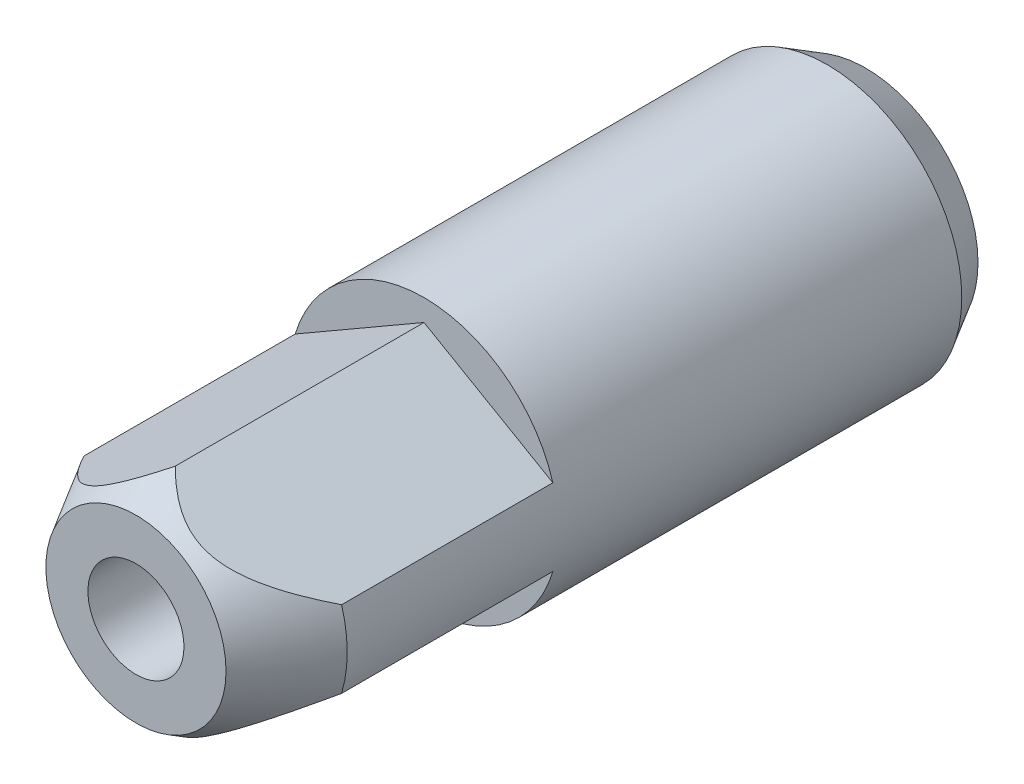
ISO-10303-21;
HEADER;
FILE_DESCRIPTION(('STEP AP214'),'2;1');
FILE_NAME('part.step','',(''),(''),'','','');
FILE_SCHEMA(('AUTOMOTIVE_DESIGN { 1 0 10303 214 1 1 1 1 }'));
ENDSEC;
DATA;
#1=APPLICATION_CONTEXT('core data for automotive mechanical design processes');
#2=APPLICATION_PROTOCOL_DEFINITION('international standard','automotive_design',2000,#1);
#3=PRODUCT_CONTEXT('',#1,'mechanical');
#4=PRODUCT('Part','Part','',(#3));
#5=PRODUCT_RELATED_PRODUCT_CATEGORY('part','',(#4));
#6=PRODUCT_DEFINITION_FORMATION('','',#4);
#7=PRODUCT_DEFINITION_CONTEXT('part definition',#1,'design');
#8=PRODUCT_DEFINITION('design','',#6,#7);
#9=PRODUCT_DEFINITION_SHAPE('','',#8);
#10=(LENGTH_UNIT() NAMED_UNIT(*) SI_UNIT(.MILLI.,.METRE.));
#11=(NAMED_UNIT(*) PLANE_ANGLE_UNIT() SI_UNIT($,.RADIAN.));
#12=(NAMED_UNIT(*) SI_UNIT($,.STERADIAN.) SOLID_ANGLE_UNIT());
#13=UNCERTAINTY_MEASURE_WITH_UNIT(LENGTH_MEASURE(1.E-05),#10,'distance_accuracy_value','');
#14=(GEOMETRIC_REPRESENTATION_CONTEXT(3) GLOBAL_UNCERTAINTY_ASSIGNED_CONTEXT((#13)) GLOBAL_UNIT_ASSIGNED_CONTEXT((#10,
#11,#12)) REPRESENTATION_CONTEXT('',''));
#15=CARTESIAN_POINT('',(0.,0.,0.));
#16=DIRECTION('',(0.,0.,1.));
#17=DIRECTION('',(1.,0.,0.));
#18=AXIS2_PLACEMENT_3D('',#15,#16,#17);
#19=CARTESIAN_POINT('',(0.,0.,34.));
#20=DIRECTION('',(0.,0.,-1.));
#21=DIRECTION('',(-1.,0.,0.));
#22=AXIS2_PLACEMENT_3D('',#19,#20,#21);
#23=CONICAL_SURFACE('',#22,7.,0.523598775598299);
#24=CARTESIAN_POINT('',(0.,0.,38.));
#25=DIRECTION('',(0.,0.,1.));
#26=DIRECTION('',(1.,0.,0.));
#27=AXIS2_PLACEMENT_3D('',#24,#25,#26);
#28=CIRCLE('',#27,4.69059892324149);
#29=CARTESIAN_POINT('',(4.69059892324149,0.,38.));
#30=VERTEX_POINT('',#29);
#31=EDGE_CURVE('E23',#30,#30,#28,.T.);
#32=ORIENTED_EDGE('',*,*,#31,.F.);
#33=EDGE_LOOP('',(#32));
#34=FACE_BOUND('',#33,.T.);
#35=CARTESIAN_POINT('',(-0.0002,5.87309881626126,35.9518500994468));
#36=CARTESIAN_POINT('',(0.0529864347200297,5.84239161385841,36.0050342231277));
#37=CARTESIAN_POINT('',(0.106703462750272,5.81137807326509,36.0575091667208));
#38=CARTESIAN_POINT('',(0.215315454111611,5.7486709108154,36.1608430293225));
#39=CARTESIAN_POINT('',(0.270210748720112,5.71697709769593,36.2117014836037));
#40=CARTESIAN_POINT('',(0.437358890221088,5.6204740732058,36.3620190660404));
#41=CARTESIAN_POINT('',(0.551534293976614,5.55455487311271,36.4586741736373));
#42=CARTESIAN_POINT('',(0.788819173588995,5.41755838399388,36.6445045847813));
#43=CARTESIAN_POINT('',(0.912084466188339,5.3463911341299,36.7334170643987));
#44=CARTESIAN_POINT('',(1.16529399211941,5.20020054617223,36.8970695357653));
#45=CARTESIAN_POINT('',(1.29522262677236,5.12518621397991,36.971840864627));
#46=CARTESIAN_POINT('',(1.50113825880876,5.00630076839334,37.0728579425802));
#47=CARTESIAN_POINT('',(1.57471376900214,4.96382192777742,37.1056861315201));
#48=CARTESIAN_POINT('',(1.72379175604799,4.87775171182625,37.1649793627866));
#49=CARTESIAN_POINT('',(1.79929437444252,4.83416025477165,37.1914439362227));
#50=CARTESIAN_POINT('',(1.95132510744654,4.74638527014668,37.2369981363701));
#51=CARTESIAN_POINT('',(2.02784035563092,4.70220917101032,37.2561445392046));
#52=CARTESIAN_POINT('',(2.18202244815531,4.61319209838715,37.2866655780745));
#53=CARTESIAN_POINT('',(2.25968907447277,4.56835125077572,37.2980416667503));
#54=CARTESIAN_POINT('',(2.41635054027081,4.47790271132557,37.3126377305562));
#55=CARTESIAN_POINT('',(2.49535097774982,4.43229178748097,37.3157786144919));
#56=CARTESIAN_POINT('',(2.65325881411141,4.34112365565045,37.3135398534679));
#57=CARTESIAN_POINT('',(2.73216621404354,4.29556644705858,37.3081603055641));
#58=CARTESIAN_POINT('',(2.88933707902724,4.20482380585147,37.2890977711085));
#59=CARTESIAN_POINT('',(2.96759940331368,4.15963903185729,37.2754023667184));
#60=CARTESIAN_POINT('',(3.12283420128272,4.07001417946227,37.2402403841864));
#61=CARTESIAN_POINT('',(3.19980587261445,4.02557456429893,37.2187691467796));
#62=CARTESIAN_POINT('',(3.37375422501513,3.9251454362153,37.1616717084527));
#63=CARTESIAN_POINT('',(3.47016647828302,3.8694817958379,37.1237542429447));
#64=CARTESIAN_POINT('',(3.65967695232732,3.76006787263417,37.038108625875));
#65=CARTESIAN_POINT('',(3.75277310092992,3.70631878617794,36.9903744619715));
#66=CARTESIAN_POINT('',(3.9363598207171,3.60032494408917,36.8863630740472));
#67=CARTESIAN_POINT('',(4.02681802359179,3.54809887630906,36.8300103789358));
#68=CARTESIAN_POINT('',(4.20431504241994,3.44562092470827,36.710654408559));
#69=CARTESIAN_POINT('',(4.29135478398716,3.39536850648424,36.6476529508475));
#70=CARTESIAN_POINT('',(4.49230790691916,3.27934816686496,36.4931903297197));
#71=CARTESIAN_POINT('',(4.60493225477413,3.21432446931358,36.3995008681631));
#72=CARTESIAN_POINT('',(4.82523970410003,3.0871299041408,36.2046332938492));
#73=CARTESIAN_POINT('',(4.93292034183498,3.02496045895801,36.1034515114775));
#74=CARTESIAN_POINT('',(5.14433636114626,2.90289936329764,35.8950283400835));
#75=CARTESIAN_POINT('',(5.2480586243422,2.84301528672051,35.7877693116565));
#76=CARTESIAN_POINT('',(5.45185763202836,2.72535187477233,35.5687242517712));
#77=CARTESIAN_POINT('',(5.55193392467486,2.66757280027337,35.4569376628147));
#78=CARTESIAN_POINT('',(5.74358661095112,2.55692207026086,35.235978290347));
#79=CARTESIAN_POINT('',(5.83532868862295,2.50395475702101,35.1269963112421));
#80=CARTESIAN_POINT('',(6.01641515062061,2.39940443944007,34.9063984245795));
#81=CARTESIAN_POINT('',(6.10575934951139,2.34782154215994,34.7947823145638));
#82=CARTESIAN_POINT('',(6.28167784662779,2.24625495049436,34.5702575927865));
#83=CARTESIAN_POINT('',(6.368268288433,2.19626193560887,34.4573657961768));
#84=CARTESIAN_POINT('',(6.53963078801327,2.09732575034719,34.2298035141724));
#85=CARTESIAN_POINT('',(6.62440328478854,2.04838232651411,34.1151334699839));
#86=CARTESIAN_POINT('',(6.70840393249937,1.99988452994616,33.9997251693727));
#87=B_SPLINE_CURVE_WITH_KNOTS('',3,(#35,#36,#37,#38,#39,#40,#41,#42,#43,#44,#45,#46,#47,#48,#49,
#50,#51,#52,#53,#54,#55,#56,#57,#58,#59,#60,#61,#62,#63,#64,#65,#66,#67,#68,#69,#70,#71,#72,#73,
#74,#75,#76,#77,#78,#79,#80,#81,#82,#83,#84,#85,#86),.UNSPECIFIED.,.F.,.F.,(4,2,2,2,2,2,2,2,2,2,
2,2,2,2,2,2,2,2,2,2,2,2,2,2,2,4),(0.,0.243715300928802,0.487500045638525,0.977552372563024,
1.48046379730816,1.98224735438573,2.25527955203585,2.52833186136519,2.79922055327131,
3.07005858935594,3.34348839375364,3.61691508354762,3.89075108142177,4.16475143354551,
4.51700036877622,4.86946568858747,5.22521580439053,5.58086892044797,6.06133859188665,
6.54204516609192,7.02422662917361,7.50646764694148,7.96236501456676,8.41829753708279,
8.87068237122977,9.32295670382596),.UNSPECIFIED.);
#88=CARTESIAN_POINT('',(0.,5.87298334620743,35.952050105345));
#89=VERTEX_POINT('',#88);
#90=CARTESIAN_POINT('',(6.70820393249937,2.,34.));
#91=VERTEX_POINT('',#90);
#92=EDGE_CURVE('E102',#89,#91,#87,.T.);
#93=ORIENTED_EDGE('',*,*,#92,.F.);
#94=CARTESIAN_POINT('',(0.0002,5.87309881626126,35.9518500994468));
#95=CARTESIAN_POINT('',(-0.0529864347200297,5.84239161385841,36.0050342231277));
#96=CARTESIAN_POINT('',(-0.106703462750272,5.81137807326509,36.0575091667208));
#97=CARTESIAN_POINT('',(-0.215315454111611,5.7486709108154,36.1608430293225));
#98=CARTESIAN_POINT('',(-0.270210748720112,5.71697709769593,36.2117014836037));
#99=CARTESIAN_POINT('',(-0.437358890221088,5.6204740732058,36.3620190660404));
#100=CARTESIAN_POINT('',(-0.551534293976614,5.55455487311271,36.4586741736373));
#101=CARTESIAN_POINT('',(-0.788819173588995,5.41755838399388,36.6445045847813));
#102=CARTESIAN_POINT('',(-0.912084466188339,5.3463911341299,36.7334170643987));
#103=CARTESIAN_POINT('',(-1.16529399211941,5.20020054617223,36.8970695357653));
#104=CARTESIAN_POINT('',(-1.29522262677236,5.12518621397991,36.971840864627));
#105=CARTESIAN_POINT('',(-1.50113825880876,5.00630076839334,37.0728579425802));
#106=CARTESIAN_POINT('',(-1.57471376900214,4.96382192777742,37.1056861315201));
#107=CARTESIAN_POINT('',(-1.72379175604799,4.87775171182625,37.1649793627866));
#108=CARTESIAN_POINT('',(-1.79929437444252,4.83416025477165,37.1914439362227));
#109=CARTESIAN_POINT('',(-1.95132510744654,4.74638527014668,37.2369981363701));
#110=CARTESIAN_POINT('',(-2.02784035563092,4.70220917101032,37.2561445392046));
#111=CARTESIAN_POINT('',(-2.18202244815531,4.61319209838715,37.2866655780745));
#112=CARTESIAN_POINT('',(-2.25968907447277,4.56835125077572,37.2980416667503));
#113=CARTESIAN_POINT('',(-2.41635054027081,4.47790271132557,37.3126377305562));
#114=CARTESIAN_POINT('',(-2.49535097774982,4.43229178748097,37.3157786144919));
#115=CARTESIAN_POINT('',(-2.65325881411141,4.34112365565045,37.3135398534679));
#116=CARTESIAN_POINT('',(-2.73216621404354,4.29556644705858,37.3081603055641));
#117=CARTESIAN_POINT('',(-2.88933707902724,4.20482380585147,37.2890977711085));
#118=CARTESIAN_POINT('',(-2.96759940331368,4.15963903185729,37.2754023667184));
#119=CARTESIAN_POINT('',(-3.12283420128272,4.07001417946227,37.2402403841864));
#120=CARTESIAN_POINT('',(-3.19980587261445,4.02557456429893,37.2187691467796));
#121=CARTESIAN_POINT('',(-3.37375422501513,3.9251454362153,37.1616717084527));
#122=CARTESIAN_POINT('',(-3.47016647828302,3.8694817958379,37.1237542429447));
#123=CARTESIAN_POINT('',(-3.65967695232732,3.76006787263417,37.038108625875));
#124=CARTESIAN_POINT('',(-3.75277310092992,3.70631878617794,36.9903744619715));
#125=CARTESIAN_POINT('',(-3.9363598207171,3.60032494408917,36.8863630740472));
#126=CARTESIAN_POINT('',(-4.02681802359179,3.54809887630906,36.8300103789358));
#127=CARTESIAN_POINT('',(-4.20431504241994,3.44562092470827,36.710654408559));
#128=CARTESIAN_POINT('',(-4.29135478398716,3.39536850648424,36.6476529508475));
#129=CARTESIAN_POINT('',(-4.49230790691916,3.27934816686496,36.4931903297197));
#130=CARTESIAN_POINT('',(-4.60493225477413,3.21432446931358,36.3995008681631));
#131=CARTESIAN_POINT('',(-4.82523970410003,3.0871299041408,36.2046332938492));
#132=CARTESIAN_POINT('',(-4.93292034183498,3.02496045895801,36.1034515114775));
#133=CARTESIAN_POINT('',(-5.14433636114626,2.90289936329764,35.8950283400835));
#134=CARTESIAN_POINT('',(-5.2480586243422,2.84301528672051,35.7877693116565));
#135=CARTESIAN_POINT('',(-5.45185763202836,2.72535187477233,35.5687242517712));
#136=CARTESIAN_POINT('',(-5.55193392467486,2.66757280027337,35.4569376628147));
#137=CARTESIAN_POINT('',(-5.74358661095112,2.55692207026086,35.235978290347));
#138=CARTESIAN_POINT('',(-5.83532868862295,2.50395475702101,35.1269963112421));
#139=CARTESIAN_POINT('',(-6.01641515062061,2.39940443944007,34.9063984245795));
#140=CARTESIAN_POINT('',(-6.10575934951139,2.34782154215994,34.7947823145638));
#141=CARTESIAN_POINT('',(-6.28167784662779,2.24625495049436,34.5702575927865));
#142=CARTESIAN_POINT('',(-6.368268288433,2.19626193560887,34.4573657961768));
#143=CARTESIAN_POINT('',(-6.53963078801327,2.09732575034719,34.2298035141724));
#144=CARTESIAN_POINT('',(-6.62440328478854,2.04838232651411,34.1151334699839));
#145=CARTESIAN_POINT('',(-6.70840393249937,1.99988452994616,33.9997251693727));
#146=B_SPLINE_CURVE_WITH_KNOTS('',3,(#94,#95,#96,#97,#98,#99,#100,#101,#102,#103,#104,#105,#106,
#107,#108,#109,#110,#111,#112,#113,#114,#115,#116,#117,#118,#119,#120,#121,#122,#123,#124,#125,
#126,#127,#128,#129,#130,#131,#132,#133,#134,#135,#136,#137,#138,#139,#140,#141,#142,#143,#144,
#145),.UNSPECIFIED.,.F.,.F.,(4,2,2,2,2,2,2,2,2,2,2,2,2,2,2,2,2,2,2,2,2,2,2,2,2,4),(0.,
0.243715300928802,0.487500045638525,0.977552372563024,1.48046379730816,1.98224735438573,
2.25527955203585,2.52833186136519,2.79922055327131,3.07005858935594,3.34348839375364,
3.61691508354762,3.89075108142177,4.16475143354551,4.51700036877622,4.86946568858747,
5.22521580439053,5.58086892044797,6.06133859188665,6.54204516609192,7.02422662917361,
7.50646764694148,7.96236501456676,8.41829753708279,8.87068237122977,9.32295670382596),.UNSPECIFIED.);
#147=CARTESIAN_POINT('',(-6.70820393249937,2.,34.));
#148=VERTEX_POINT('',#147);
#149=EDGE_CURVE('E75',#89,#148,#146,.T.);
#150=ORIENTED_EDGE('',*,*,#149,.T.);
#151=CARTESIAN_POINT('',(0.,0.,34.));
#152=DIRECTION('',(0.,0.,1.));
#153=DIRECTION('',(1.,0.,0.));
#154=AXIS2_PLACEMENT_3D('',#151,#152,#153);
#155=CIRCLE('',#154,7.);
#156=CARTESIAN_POINT('',(-6.70820393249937,-2.,34.));
#157=VERTEX_POINT('',#156);
#158=EDGE_CURVE('E155',#148,#157,#155,.T.);
#159=ORIENTED_EDGE('',*,*,#158,.T.);
#160=CARTESIAN_POINT('',(0.000199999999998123,-5.8730988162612,35.9518500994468));
#161=CARTESIAN_POINT('',(-0.0529864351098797,-5.8423916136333,36.0050342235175));
#162=CARTESIAN_POINT('',(-0.106703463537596,-5.81137807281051,36.0575091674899));
#163=CARTESIAN_POINT('',(-0.215315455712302,-5.74867090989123,36.1608430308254));
#164=CARTESIAN_POINT('',(-0.270210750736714,-5.71697709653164,36.211701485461));
#165=CARTESIAN_POINT('',(-0.4373588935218,-5.62047407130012,36.3620190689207));
#166=CARTESIAN_POINT('',(-0.551534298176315,-5.554554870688,36.4586741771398));
#167=CARTESIAN_POINT('',(-0.788819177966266,-5.41755838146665,36.6445045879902));
#168=CARTESIAN_POINT('',(-0.912084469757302,-5.34639113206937,36.7334170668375));
#169=CARTESIAN_POINT('',(-1.16529399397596,-5.20020054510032,36.8970695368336));
#170=CARTESIAN_POINT('',(-1.29522262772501,-5.12518621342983,36.9718408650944));
#171=CARTESIAN_POINT('',(-1.50113825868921,-5.00630076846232,37.0728579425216));
#172=CARTESIAN_POINT('',(-1.57471376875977,-4.96382192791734,37.105686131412));
#173=CARTESIAN_POINT('',(-1.72379175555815,-4.87775171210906,37.1649793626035));
#174=CARTESIAN_POINT('',(-1.79929437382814,-4.83416025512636,37.1914439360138));
#175=CARTESIAN_POINT('',(-1.95132510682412,-4.74638527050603,37.2369981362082));
#176=CARTESIAN_POINT('',(-2.02784035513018,-4.70220917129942,37.2561445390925));
#177=CARTESIAN_POINT('',(-2.18202244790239,-4.61319209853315,37.2866655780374));
#178=CARTESIAN_POINT('',(-2.25968907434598,-4.56835125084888,37.2980416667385));
#179=CARTESIAN_POINT('',(-2.41635053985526,-4.47790271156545,37.3126377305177));
#180=CARTESIAN_POINT('',(-2.49535097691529,-4.43229178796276,37.3157786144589));
#181=CARTESIAN_POINT('',(-2.65325881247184,-4.34112365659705,37.313539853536));
#182=CARTESIAN_POINT('',(-2.73216621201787,-4.2955664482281,37.3081603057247));
#183=CARTESIAN_POINT('',(-2.88933707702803,-4.20482380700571,37.2890977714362));
#184=CARTESIAN_POINT('',(-2.96759940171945,-4.15963903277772,37.275402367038));
#185=CARTESIAN_POINT('',(-3.12283420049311,-4.07001417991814,37.2402403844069));
#186=CARTESIAN_POINT('',(-3.19980587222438,-4.0255745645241,37.2187691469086));
#187=CARTESIAN_POINT('',(-3.37375423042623,-3.92514543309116,37.1616717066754));
#188=CARTESIAN_POINT('',(-3.47016648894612,-3.86948178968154,37.1237542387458));
#189=CARTESIAN_POINT('',(-3.6596769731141,-3.76006786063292,37.0381086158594));
#190=CARTESIAN_POINT('',(-3.7527731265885,-3.70631877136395,36.990374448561));
#191=CARTESIAN_POINT('',(-3.93635984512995,-3.6003249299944,36.8863630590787));
#192=CARTESIAN_POINT('',(-4.02681804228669,-3.54809886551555,36.830010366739));
#193=CARTESIAN_POINT('',(-4.20431505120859,-3.44562091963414,36.7106544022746));
#194=CARTESIAN_POINT('',(-4.29135478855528,-3.39536850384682,36.6476529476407));
#195=CARTESIAN_POINT('',(-4.4923047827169,-3.27934997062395,36.4931927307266));
#196=CARTESIAN_POINT('',(-4.6049261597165,-3.21432798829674,36.3995059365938));
#197=CARTESIAN_POINT('',(-4.82522791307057,-3.08713671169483,36.2046440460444));
#198=CARTESIAN_POINT('',(-4.93290582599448,-3.02496883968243,36.1034652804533));
#199=CARTESIAN_POINT('',(-5.14431656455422,-2.90291079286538,35.8950483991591));
#200=CARTESIAN_POINT('',(-5.24803627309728,-2.84302819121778,35.7877926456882));
#201=CARTESIAN_POINT('',(-5.45183032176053,-2.72536764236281,35.5687542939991));
#202=CARTESIAN_POINT('',(-5.55190421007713,-2.66758995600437,35.4569711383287));
#203=CARTESIAN_POINT('',(-5.74355252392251,-2.556941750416,35.2360183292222));
#204=CARTESIAN_POINT('',(-5.83529262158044,-2.50397558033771,35.1270394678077));
#205=CARTESIAN_POINT('',(-6.01637519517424,-2.39942750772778,34.9064478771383));
#206=CARTESIAN_POINT('',(-6.10571748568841,-2.34784571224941,34.7948349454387));
#207=CARTESIAN_POINT('',(-6.28163227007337,-2.24628126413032,34.5703165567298));
#208=CARTESIAN_POINT('',(-6.36822090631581,-2.19628929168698,34.4574279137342));
#209=CARTESIAN_POINT('',(-6.53957983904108,-2.09735516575,34.2298719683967));
#210=CARTESIAN_POINT('',(-6.62435057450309,-2.04841275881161,34.115205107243));
#211=CARTESIAN_POINT('',(-6.70834947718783,-1.99991596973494,33.9998));
#212=B_SPLINE_CURVE_WITH_KNOTS('',3,(#160,#161,#162,#163,#164,#165,#166,#167,#168,#169,#170,
#171,#172,#173,#174,#175,#176,#177,#178,#179,#180,#181,#182,#183,#184,#185,#186,#187,#188,#189,
#190,#191,#192,#193,#194,#195,#196,#197,#198,#199,#200,#201,#202,#203,#204,#205,#206,#207,#208,
#209,#210,#211),.UNSPECIFIED.,.F.,.F.,(4,2,2,2,2,2,2,2,2,2,2,2,2,2,2,2,2,2,2,2,2,2,2,2,2,4),(0.,
0.243715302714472,0.487500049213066,0.977552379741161,1.48046380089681,1.98224735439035,
2.25527955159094,2.52833186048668,2.79922055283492,3.0700585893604,3.3434883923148,
3.61691508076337,3.89075108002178,4.16475143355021,4.51700038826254,4.86946572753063,
5.22521582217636,5.58086892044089,6.06132559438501,6.54201914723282,7.02418747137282,
7.50641534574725,7.96230122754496,8.41822226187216,8.87059586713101,9.32285897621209),.UNSPECIFIED.);
#213=CARTESIAN_POINT('',(0.,-5.87298334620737,35.9520501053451));
#214=VERTEX_POINT('',#213);
#215=EDGE_CURVE('E129',#214,#157,#212,.T.);
#216=ORIENTED_EDGE('',*,*,#215,.F.);
#217=CARTESIAN_POINT('',(-0.000200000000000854,-5.8730988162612,35.9518500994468));
#218=CARTESIAN_POINT('',(0.0529864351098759,-5.8423916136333,36.0050342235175));
#219=CARTESIAN_POINT('',(0.106703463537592,-5.8113780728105,36.0575091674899));
#220=CARTESIAN_POINT('',(0.215315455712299,-5.74867090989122,36.1608430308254));
#221=CARTESIAN_POINT('',(0.270210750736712,-5.71697709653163,36.2117014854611));
#222=CARTESIAN_POINT('',(0.437358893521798,-5.62047407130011,36.3620190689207));
#223=CARTESIAN_POINT('',(0.551534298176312,-5.55455487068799,36.4586741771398));
#224=CARTESIAN_POINT('',(0.78881917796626,-5.41755838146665,36.6445045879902));
#225=CARTESIAN_POINT('',(0.912084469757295,-5.34639113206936,36.7334170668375));
#226=CARTESIAN_POINT('',(1.16529399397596,-5.20020054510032,36.8970695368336));
#227=CARTESIAN_POINT('',(1.29522262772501,-5.12518621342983,36.9718408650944));
#228=CARTESIAN_POINT('',(1.50113825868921,-5.00630076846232,37.0728579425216));
#229=CARTESIAN_POINT('',(1.57471376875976,-4.96382192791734,37.105686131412));
#230=CARTESIAN_POINT('',(1.72379175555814,-4.87775171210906,37.1649793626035));
#231=CARTESIAN_POINT('',(1.79929437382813,-4.83416025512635,37.1914439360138));
#232=CARTESIAN_POINT('',(1.95132510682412,-4.74638527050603,37.2369981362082));
#233=CARTESIAN_POINT('',(2.02784035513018,-4.70220917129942,37.2561445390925));
#234=CARTESIAN_POINT('',(2.18202244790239,-4.61319209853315,37.2866655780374));
#235=CARTESIAN_POINT('',(2.25968907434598,-4.56835125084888,37.2980416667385));
#236=CARTESIAN_POINT('',(2.41635053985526,-4.47790271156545,37.3126377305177));
#237=CARTESIAN_POINT('',(2.49535097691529,-4.43229178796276,37.3157786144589));
#238=CARTESIAN_POINT('',(2.65325881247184,-4.34112365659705,37.313539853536));
#239=CARTESIAN_POINT('',(2.73216621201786,-4.29556644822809,37.3081603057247));
#240=CARTESIAN_POINT('',(2.88933707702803,-4.20482380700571,37.2890977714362));
#241=CARTESIAN_POINT('',(2.96759940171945,-4.15963903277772,37.275402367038));
#242=CARTESIAN_POINT('',(3.12283420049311,-4.07001417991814,37.2402403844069));
#243=CARTESIAN_POINT('',(3.19980587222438,-4.0255745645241,37.2187691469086));
#244=CARTESIAN_POINT('',(3.37375423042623,-3.92514543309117,37.1616717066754));
#245=CARTESIAN_POINT('',(3.47016648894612,-3.86948178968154,37.1237542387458));
#246=CARTESIAN_POINT('',(3.6596769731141,-3.76006786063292,37.0381086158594));
#247=CARTESIAN_POINT('',(3.7527731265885,-3.70631877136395,36.990374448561));
#248=CARTESIAN_POINT('',(3.93635984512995,-3.6003249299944,36.8863630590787));
#249=CARTESIAN_POINT('',(4.02681804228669,-3.54809886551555,36.830010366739));
#250=CARTESIAN_POINT('',(4.20431505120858,-3.44562091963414,36.7106544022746));
#251=CARTESIAN_POINT('',(4.29135478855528,-3.39536850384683,36.6476529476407));
#252=CARTESIAN_POINT('',(4.4923047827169,-3.27934997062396,36.4931927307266));
#253=CARTESIAN_POINT('',(4.60492615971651,-3.21432798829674,36.3995059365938));
#254=CARTESIAN_POINT('',(4.82522791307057,-3.08713671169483,36.2046440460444));
#255=CARTESIAN_POINT('',(4.93290582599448,-3.02496883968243,36.1034652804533));
#256=CARTESIAN_POINT('',(5.14431656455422,-2.90291079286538,35.8950483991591));
#257=CARTESIAN_POINT('',(5.24803627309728,-2.84302819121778,35.7877926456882));
#258=CARTESIAN_POINT('',(5.45183032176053,-2.72536764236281,35.5687542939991));
#259=CARTESIAN_POINT('',(5.55190421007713,-2.66758995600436,35.4569711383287));
#260=CARTESIAN_POINT('',(5.74355252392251,-2.556941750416,35.2360183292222));
#261=CARTESIAN_POINT('',(5.83529262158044,-2.50397558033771,35.1270394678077));
#262=CARTESIAN_POINT('',(6.01637519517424,-2.39942750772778,34.9064478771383));
#263=CARTESIAN_POINT('',(6.10571748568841,-2.34784571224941,34.7948349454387));
#264=CARTESIAN_POINT('',(6.28163227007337,-2.24628126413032,34.5703165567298));
#265=CARTESIAN_POINT('',(6.36822090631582,-2.19628929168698,34.4574279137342));
#266=CARTESIAN_POINT('',(6.53957983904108,-2.09735516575,34.2298719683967));
#267=CARTESIAN_POINT('',(6.62435057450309,-2.04841275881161,34.115205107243));
#268=CARTESIAN_POINT('',(6.70834947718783,-1.99991596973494,33.9998));
#269=B_SPLINE_CURVE_WITH_KNOTS('',3,(#217,#218,#219,#220,#221,#222,#223,#224,#225,#226,#227,
#228,#229,#230,#231,#232,#233,#234,#235,#236,#237,#238,#239,#240,#241,#242,#243,#244,#245,#246,
#247,#248,#249,#250,#251,#252,#253,#254,#255,#256,#257,#258,#259,#260,#261,#262,#263,#264,#265,
#266,#267,#268),.UNSPECIFIED.,.F.,.F.,(4,2,2,2,2,2,2,2,2,2,2,2,2,2,2,2,2,2,2,2,2,2,2,2,2,4),(0.,
0.243715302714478,0.487500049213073,0.977552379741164,1.48046380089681,1.98224735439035,
2.25527955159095,2.52833186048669,2.79922055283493,3.0700585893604,3.3434883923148,
3.61691508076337,3.89075108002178,4.16475143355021,4.51700038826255,4.86946572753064,
5.22521582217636,5.58086892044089,6.06132559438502,6.54201914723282,7.02418747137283,
7.50641534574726,7.96230122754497,8.41822226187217,8.87059586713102,9.3228589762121),.UNSPECIFIED.);
#270=CARTESIAN_POINT('',(6.70820393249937,-2.,34.));
#271=VERTEX_POINT('',#270);
#272=EDGE_CURVE('E138',#214,#271,#269,.T.);
#273=ORIENTED_EDGE('',*,*,#272,.T.);
#274=EDGE_CURVE('E156',#271,#91,#155,.T.);
#275=ORIENTED_EDGE('',*,*,#274,.T.);
#276=EDGE_LOOP('',(#93,#150,#159,#216,#273,#275));
#277=FACE_BOUND('',#276,.T.);
#278=ADVANCED_FACE('F15',(#34,#277),#23,.T.);
#279=CARTESIAN_POINT('',(0.,0.,30.));
#280=DIRECTION('',(0.,0.,1.));
#281=DIRECTION('',(1.,0.,0.));
#282=AXIS2_PLACEMENT_3D('',#279,#280,#281);
#283=CYLINDRICAL_SURFACE('',#282,7.);
#284=CARTESIAN_POINT('',(0.,0.,2.));
#285=DIRECTION('',(0.,0.,1.));
#286=DIRECTION('',(1.,0.,0.));
#287=AXIS2_PLACEMENT_3D('',#284,#285,#286);
#288=CIRCLE('',#287,7.);
#289=CARTESIAN_POINT('',(7.,0.,2.));
#290=VERTEX_POINT('',#289);
#291=EDGE_CURVE('E152',#290,#290,#288,.T.);
#292=ORIENTED_EDGE('',*,*,#291,.T.);
#293=EDGE_LOOP('',(#292));
#294=FACE_BOUND('',#293,.T.);
#295=DIRECTION('',(0.,0.,1.));
#296=VECTOR('',#295,1.);
#297=CARTESIAN_POINT('',(6.70820393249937,2.,23.));
#298=LINE('',#297,#296);
#299=CARTESIAN_POINT('',(6.70820393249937,2.,23.));
#300=VERTEX_POINT('',#299);
#301=EDGE_CURVE('E82',#300,#91,#298,.T.);
#302=ORIENTED_EDGE('',*,*,#301,.T.);
#303=ORIENTED_EDGE('',*,*,#274,.F.);
#304=DIRECTION('',(0.,0.,1.));
#305=VECTOR('',#304,1.);
#306=CARTESIAN_POINT('',(6.70820393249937,-2.,23.));
#307=LINE('',#306,#305);
#308=CARTESIAN_POINT('',(6.70820393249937,-2.,23.));
#309=VERTEX_POINT('',#308);
#310=EDGE_CURVE('E179',#309,#271,#307,.T.);
#311=ORIENTED_EDGE('',*,*,#310,.F.);
#312=CARTESIAN_POINT('',(0.,0.,23.));
#313=DIRECTION('',(0.,0.,1.));
#314=DIRECTION('',(1.,0.,0.));
#315=AXIS2_PLACEMENT_3D('',#312,#313,#314);
#316=CIRCLE('',#315,7.);
#317=CARTESIAN_POINT('',(-6.70820393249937,-2.,23.));
#318=VERTEX_POINT('',#317);
#319=EDGE_CURVE('E169',#318,#309,#316,.T.);
#320=ORIENTED_EDGE('',*,*,#319,.F.);
#321=DIRECTION('',(0.,0.,1.));
#322=VECTOR('',#321,1.);
#323=CARTESIAN_POINT('',(-6.70820393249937,-2.,23.));
#324=LINE('',#323,#322);
#325=EDGE_CURVE('E176',#318,#157,#324,.T.);
#326=ORIENTED_EDGE('',*,*,#325,.T.);
#327=ORIENTED_EDGE('',*,*,#158,.F.);
#328=DIRECTION('',(0.,0.,1.));
#329=VECTOR('',#328,1.);
#330=CARTESIAN_POINT('',(-6.70820393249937,2.,23.));
#331=LINE('',#330,#329);
#332=CARTESIAN_POINT('',(-6.70820393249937,2.,23.));
#333=VERTEX_POINT('',#332);
#334=EDGE_CURVE('E78',#333,#148,#331,.T.);
#335=ORIENTED_EDGE('',*,*,#334,.F.);
#336=CARTESIAN_POINT('',(0.,0.,23.));
#337=DIRECTION('',(0.,0.,1.));
#338=DIRECTION('',(1.,0.,0.));
#339=AXIS2_PLACEMENT_3D('',#336,#337,#338);
#340=CIRCLE('',#339,7.);
#341=EDGE_CURVE('E86',#300,#333,#340,.T.);
#342=ORIENTED_EDGE('',*,*,#341,.F.);
#343=EDGE_LOOP('',(#302,#303,#311,#320,#326,#327,#335,#342));
#344=FACE_BOUND('',#343,.T.);
#345=ADVANCED_FACE('F165',(#294,#344),#283,.T.);
#346=CARTESIAN_POINT('',(0.,0.,30.));
#347=DIRECTION('',(0.,0.,1.));
#348=DIRECTION('',(1.,0.,0.));
#349=AXIS2_PLACEMENT_3D('',#346,#347,#348);
#350=CYLINDRICAL_SURFACE('',#349,2.5);
#351=CARTESIAN_POINT('',(0.,0.,28.));
#352=DIRECTION('',(0.,0.,1.));
#353=DIRECTION('',(1.,0.,0.));
#354=AXIS2_PLACEMENT_3D('',#351,#352,#353);
#355=CIRCLE('',#354,2.5);
#356=CARTESIAN_POINT('',(2.5,0.,28.));
#357=VERTEX_POINT('',#356);
#358=EDGE_CURVE('E89',#357,#357,#355,.T.);
#359=ORIENTED_EDGE('',*,*,#358,.F.);
#360=EDGE_LOOP('',(#359));
#361=FACE_BOUND('',#360,.T.);
#362=CARTESIAN_POINT('',(0.,0.,38.));
#363=DIRECTION('',(0.,0.,1.));
#364=DIRECTION('',(1.,0.,0.));
#365=AXIS2_PLACEMENT_3D('',#362,#363,#364);
#366=CIRCLE('',#365,2.5);
#367=CARTESIAN_POINT('',(2.5,0.,38.));
#368=VERTEX_POINT('',#367);
#369=EDGE_CURVE('E9',#368,#368,#366,.T.);
#370=ORIENTED_EDGE('',*,*,#369,.T.);
#371=EDGE_LOOP('',(#370));
#372=FACE_BOUND('',#371,.T.);
#373=ADVANCED_FACE('F17',(#361,#372),#350,.F.);
#374=CARTESIAN_POINT('',(4.69059892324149,0.,38.));
#375=DIRECTION('',(0.,0.,-1.));
#376=DIRECTION('',(-1.,0.,0.));
#377=AXIS2_PLACEMENT_3D('',#374,#375,#376);
#378=PLANE('',#377);
#379=ORIENTED_EDGE('',*,*,#369,.F.);
#380=EDGE_LOOP('',(#379));
#381=FACE_BOUND('',#380,.T.);
#382=ORIENTED_EDGE('',*,*,#31,.T.);
#383=EDGE_LOOP('',(#382));
#384=FACE_BOUND('',#383,.T.);
#385=ADVANCED_FACE('F161',(#381,#384),#378,.F.);
#386=CARTESIAN_POINT('',(0.,0.,0.));
#387=DIRECTION('',(0.,0.,1.));
#388=DIRECTION('',(1.,0.,0.));
#389=AXIS2_PLACEMENT_3D('',#386,#387,#388);
#390=CONICAL_SURFACE('',#389,5.84529946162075,0.523598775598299);
#391=ORIENTED_EDGE('',*,*,#291,.F.);
#392=EDGE_LOOP('',(#391));
#393=FACE_BOUND('',#392,.T.);
#394=CARTESIAN_POINT('',(0.,0.,0.));
#395=DIRECTION('',(0.,0.,1.));
#396=DIRECTION('',(1.,0.,0.));
#397=AXIS2_PLACEMENT_3D('',#394,#395,#396);
#398=CIRCLE('',#397,5.84529946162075);
#399=CARTESIAN_POINT('',(5.84529946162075,0.,0.));
#400=VERTEX_POINT('',#399);
#401=EDGE_CURVE('E149',#400,#400,#398,.T.);
#402=ORIENTED_EDGE('',*,*,#401,.T.);
#403=EDGE_LOOP('',(#402));
#404=FACE_BOUND('',#403,.T.);
#405=ADVANCED_FACE('F252',(#393,#404),#390,.T.);
#406=CARTESIAN_POINT('',(1.,0.,0.));
#407=DIRECTION('',(0.,0.,1.));
#408=DIRECTION('',(1.,0.,0.));
#409=AXIS2_PLACEMENT_3D('',#406,#407,#408);
#410=PLANE('',#409);
#411=ORIENTED_EDGE('',*,*,#401,.F.);
#412=EDGE_LOOP('',(#411));
#413=FACE_BOUND('',#412,.T.);
#414=CARTESIAN_POINT('',(0.,0.,0.));
#415=DIRECTION('',(0.,0.,1.));
#416=DIRECTION('',(1.,0.,0.));
#417=AXIS2_PLACEMENT_3D('',#414,#415,#416);
#418=CIRCLE('',#417,1.);
#419=CARTESIAN_POINT('',(1.,0.,0.));
#420=VERTEX_POINT('',#419);
#421=EDGE_CURVE('E146',#420,#420,#418,.T.);
#422=ORIENTED_EDGE('',*,*,#421,.T.);
#423=EDGE_LOOP('',(#422));
#424=FACE_BOUND('',#423,.T.);
#425=ADVANCED_FACE('F257',(#413,#424),#410,.F.);
#426=CARTESIAN_POINT('',(0.,0.,30.));
#427=DIRECTION('',(0.,0.,1.));
#428=DIRECTION('',(1.,0.,0.));
#429=AXIS2_PLACEMENT_3D('',#426,#427,#428);
#430=CYLINDRICAL_SURFACE('',#429,1.);
#431=ORIENTED_EDGE('',*,*,#421,.F.);
#432=EDGE_LOOP('',(#431));
#433=FACE_BOUND('',#432,.T.);
#434=CARTESIAN_POINT('',(0.,0.,4.));
#435=DIRECTION('',(0.,0.,1.));
#436=DIRECTION('',(1.,0.,0.));
#437=AXIS2_PLACEMENT_3D('',#434,#435,#436);
#438=CIRCLE('',#437,1.);
#439=CARTESIAN_POINT('',(1.,0.,4.));
#440=VERTEX_POINT('',#439);
#441=EDGE_CURVE('E137',#440,#440,#438,.T.);
#442=ORIENTED_EDGE('',*,*,#441,.T.);
#443=EDGE_LOOP('',(#442));
#444=FACE_BOUND('',#443,.T.);
#445=ADVANCED_FACE('F266',(#433,#444),#430,.F.);
#446=CARTESIAN_POINT('',(0.,0.,4.));
#447=DIRECTION('',(0.,0.,1.));
#448=DIRECTION('',(1.,0.,0.));
#449=AXIS2_PLACEMENT_3D('',#446,#447,#448);
#450=PLANE('',#449);
#451=ORIENTED_EDGE('',*,*,#441,.F.);
#452=EDGE_LOOP('',(#451));
#453=FACE_BOUND('',#452,.T.);
#454=ADVANCED_FACE('F124',(#453),#450,.F.);
#455=CARTESIAN_POINT('',(-6.70820393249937,-2.,23.));
#456=DIRECTION('',(-0.5,-0.866025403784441,0.));
#457=DIRECTION('',(0.866025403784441,-0.5,0.));
#458=AXIS2_PLACEMENT_3D('',#455,#456,#457);
#459=PLANE('',#458);
#460=ORIENTED_EDGE('',*,*,#215,.T.);
#461=ORIENTED_EDGE('',*,*,#325,.F.);
#462=DIRECTION('',(0.866025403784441,-0.5,0.));
#463=VECTOR('',#462,1.);
#464=CARTESIAN_POINT('',(-6.70820393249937,-2.,23.));
#465=LINE('',#464,#463);
#466=CARTESIAN_POINT('',(0.,-5.87298334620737,23.));
#467=VERTEX_POINT('',#466);
#468=EDGE_CURVE('E38',#318,#467,#465,.T.);
#469=ORIENTED_EDGE('',*,*,#468,.T.);
#470=DIRECTION('',(0.,0.,1.));
#471=VECTOR('',#470,1.);
#472=CARTESIAN_POINT('',(0.,-5.87298334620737,23.));
#473=LINE('',#472,#471);
#474=EDGE_CURVE('E180',#467,#214,#473,.T.);
#475=ORIENTED_EDGE('',*,*,#474,.T.);
#476=EDGE_LOOP('',(#460,#461,#469,#475));
#477=FACE_BOUND('',#476,.T.);
#478=ADVANCED_FACE('F120',(#477),#459,.T.);
#479=CARTESIAN_POINT('',(6.70820393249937,-2.,23.));
#480=DIRECTION('',(-0.5,0.866025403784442,0.));
#481=DIRECTION('',(-0.866025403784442,-0.5,0.));
#482=AXIS2_PLACEMENT_3D('',#479,#480,#481);
#483=PLANE('',#482);
#484=ORIENTED_EDGE('',*,*,#474,.F.);
#485=DIRECTION('',(-0.866025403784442,-0.5,0.));
#486=VECTOR('',#485,1.);
#487=CARTESIAN_POINT('',(6.70820393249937,-2.,23.));
#488=LINE('',#487,#486);
#489=EDGE_CURVE('E170',#309,#467,#488,.T.);
#490=ORIENTED_EDGE('',*,*,#489,.F.);
#491=ORIENTED_EDGE('',*,*,#310,.T.);
#492=ORIENTED_EDGE('',*,*,#272,.F.);
#493=EDGE_LOOP('',(#484,#490,#491,#492));
#494=FACE_BOUND('',#493,.T.);
#495=ADVANCED_FACE('F119',(#494),#483,.F.);
#496=CARTESIAN_POINT('',(0.,0.,23.));
#497=DIRECTION('',(0.,0.,1.));
#498=DIRECTION('',(1.,0.,0.));
#499=AXIS2_PLACEMENT_3D('',#496,#497,#498);
#500=PLANE('',#499);
#501=ORIENTED_EDGE('',*,*,#468,.F.);
#502=ORIENTED_EDGE('',*,*,#319,.T.);
#503=ORIENTED_EDGE('',*,*,#489,.T.);
#504=EDGE_LOOP('',(#501,#502,#503));
#505=FACE_BOUND('',#504,.T.);
#506=ADVANCED_FACE('F116',(#505),#500,.T.);
#507=CARTESIAN_POINT('',(6.70820393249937,2.,23.));
#508=DIRECTION('',(0.5,0.866025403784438,0.));
#509=DIRECTION('',(-0.866025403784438,0.5,0.));
#510=AXIS2_PLACEMENT_3D('',#507,#508,#509);
#511=PLANE('',#510);
#512=ORIENTED_EDGE('',*,*,#92,.T.);
#513=ORIENTED_EDGE('',*,*,#301,.F.);
#514=DIRECTION('',(-0.866025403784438,0.5,0.));
#515=VECTOR('',#514,1.);
#516=CARTESIAN_POINT('',(6.70820393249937,2.,23.));
#517=LINE('',#516,#515);
#518=CARTESIAN_POINT('',(0.,5.87298334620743,23.));
#519=VERTEX_POINT('',#518);
#520=EDGE_CURVE('E30',#300,#519,#517,.T.);
#521=ORIENTED_EDGE('',*,*,#520,.T.);
#522=DIRECTION('',(0.,0.,1.));
#523=VECTOR('',#522,1.);
#524=CARTESIAN_POINT('',(0.,5.87298334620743,23.));
#525=LINE('',#524,#523);
#526=EDGE_CURVE('E71',#519,#89,#525,.T.);
#527=ORIENTED_EDGE('',*,*,#526,.T.);
#528=EDGE_LOOP('',(#512,#513,#521,#527));
#529=FACE_BOUND('',#528,.T.);
#530=ADVANCED_FACE('F80',(#529),#511,.T.);
#531=CARTESIAN_POINT('',(-6.70820393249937,2.,23.));
#532=DIRECTION('',(0.5,-0.866025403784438,0.));
#533=DIRECTION('',(0.866025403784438,0.5,0.));
#534=AXIS2_PLACEMENT_3D('',#531,#532,#533);
#535=PLANE('',#534);
#536=ORIENTED_EDGE('',*,*,#526,.F.);
#537=DIRECTION('',(0.866025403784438,0.5,0.));
#538=VECTOR('',#537,1.);
#539=CARTESIAN_POINT('',(-6.70820393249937,2.,23.));
#540=LINE('',#539,#538);
#541=EDGE_CURVE('E73',#333,#519,#540,.T.);
#542=ORIENTED_EDGE('',*,*,#541,.F.);
#543=ORIENTED_EDGE('',*,*,#334,.T.);
#544=ORIENTED_EDGE('',*,*,#149,.F.);
#545=EDGE_LOOP('',(#536,#542,#543,#544));
#546=FACE_BOUND('',#545,.T.);
#547=ADVANCED_FACE('F72',(#546),#535,.F.);
#548=CARTESIAN_POINT('',(0.,0.,23.));
#549=DIRECTION('',(0.,0.,1.));
#550=DIRECTION('',(1.,0.,0.));
#551=AXIS2_PLACEMENT_3D('',#548,#549,#550);
#552=PLANE('',#551);
#553=ORIENTED_EDGE('',*,*,#520,.F.);
#554=ORIENTED_EDGE('',*,*,#341,.T.);
#555=ORIENTED_EDGE('',*,*,#541,.T.);
#556=EDGE_LOOP('',(#553,#554,#555));
#557=FACE_BOUND('',#556,.T.);
#558=ADVANCED_FACE('F85',(#557),#552,.T.);
#559=CARTESIAN_POINT('',(0.,0.,28.));
#560=DIRECTION('',(0.,0.,1.));
#561=DIRECTION('',(1.,0.,0.));
#562=AXIS2_PLACEMENT_3D('',#559,#560,#561);
#563=PLANE('',#562);
#564=ORIENTED_EDGE('',*,*,#358,.T.);
#565=EDGE_LOOP('',(#564));
#566=FACE_BOUND('',#565,.T.);
#567=ADVANCED_FACE('F217',(#566),#563,.T.);
#568=CLOSED_SHELL('',(#278,#345,#373,#385,#405,#425,#445,#454,#478,#495,#506,#530,#547,#558,#567));
#569=MANIFOLD_SOLID_BREP('B1',#568);
#570=ADVANCED_BREP_SHAPE_REPRESENTATION('',(#18,#569),#14);
#571=SHAPE_DEFINITION_REPRESENTATION(#9,#570);
ENDSEC;
END-ISO-10303-21;
